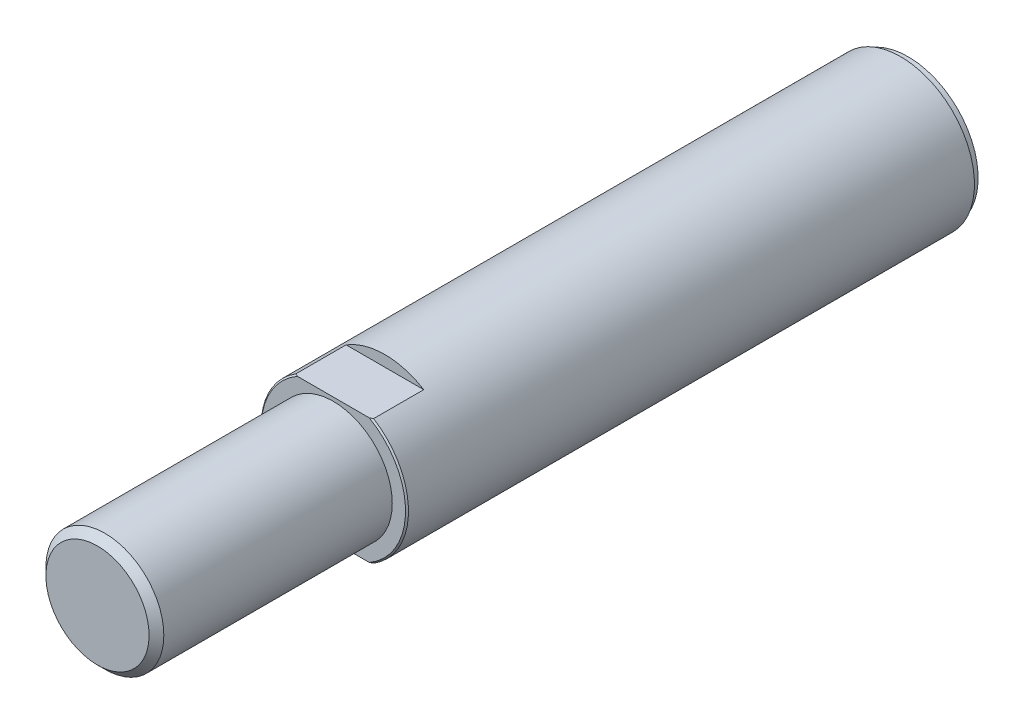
from build123d import *

# Parameters (mm, degrees)
ESBO_O1_R                      = 10
RESSALTO_EXTRUS_O1_DEPTH       = 110
ESBO_O2_OUTSIDE_W              = 44.716
ESBO_O2_OUTSIDE_H              = 44.716
ESBO_O2_OUTSIDE_R              = 8
CORTE_EXTRUS_O1_DEPTH          = 32
FURO_ROSCADO_DE_M10X1_51_D     = 8.5
FURO_ROSCADO_DE_M10X1_51_DEPTH = 27.5
FURO_ROSCADO_DE_M10X1_51_TIP   = 2.553657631
ESBO_O6_OUTSIDE_W              = 44.716
ESBO_O6_OUTSIDE_H              = 44.716
ESBO_O6_OUTSIDE_R              = 9.5
CORTE_EXTRUS_O2_DEPTH          = 1
CHANFRO1_SIZE                  = 1
CHANFRO2_SIZE                  = 0.2
ESBO_O7_OUTSIDE_W              = 44.716
ESBO_O7_OUTSIDE_H              = 44.716
ESBO_O7_OUTSIDE_W_2            = 31.474108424
ESBO_O7_OUTSIDE_H_2            = 17
CORTE_EXTRUS_O3_DEPTH          = 7


with BuildPart() as part:
    # Esbo_o1 → Ressalto-extrus_o1 (new body)
    with BuildSketch(Plane.XY):
        Circle(ESBO_O1_R)
    extrude(amount=RESSALTO_EXTRUS_O1_DEPTH)

    # Esbo_o2 outside → Corte-extrus_o1 (cut)
    with BuildSketch(Plane.XY.offset(110)):
        Rectangle(ESBO_O2_OUTSIDE_W, ESBO_O2_OUTSIDE_H)
        Circle(ESBO_O2_OUTSIDE_R, mode=Mode.SUBTRACT)
    extrude(amount=-CORTE_EXTRUS_O1_DEPTH, mode=Mode.SUBTRACT)

    # Furo roscado de M10x1.51
    with Locations(Plane(origin=(0, 0, 0), x_dir=(-1, 0, 0), z_dir=(0, 0, -1))):
        with Locations((0, 0)):
            Hole(FURO_ROSCADO_DE_M10X1_51_D / 2, depth=FURO_ROSCADO_DE_M10X1_51_DEPTH)
            with Locations((0, 0, -(FURO_ROSCADO_DE_M10X1_51_DEPTH + FURO_ROSCADO_DE_M10X1_51_TIP / 2))):  # 118° drill point
                Cone(0, FURO_ROSCADO_DE_M10X1_51_D / 2, FURO_ROSCADO_DE_M10X1_51_TIP, mode=Mode.SUBTRACT)

    # Esbo_o6 outside → Corte-extrus_o2 (cut)
    with BuildSketch(Plane(origin=(0, 0, 0), x_dir=(-1, 0, 0), z_dir=(0, 0, -1))):
        Rectangle(ESBO_O6_OUTSIDE_W, ESBO_O6_OUTSIDE_H)
        Circle(ESBO_O6_OUTSIDE_R, mode=Mode.SUBTRACT)
    extrude(amount=-CORTE_EXTRUS_O2_DEPTH, mode=Mode.SUBTRACT)

    # Chanfro1
    chanfro1_edges = [part.edges().sort_by_distance(p)[0] for p in [
        (-8, 0, 110),
    ]]
    chamfer(chanfro1_edges, length=CHANFRO1_SIZE)

    # Chanfro2
    chanfro2_edges = [part.edges().sort_by_distance(p)[0] for p in [
        (-10, 0, 78),
    ]]
    chamfer(chanfro2_edges, length=CHANFRO2_SIZE)

    # Esbo_o7 outside → Corte-extrus_o3 (cut)
    with BuildSketch(Plane.XY.offset(78)):
        Rectangle(ESBO_O7_OUTSIDE_W, ESBO_O7_OUTSIDE_H)
        Rectangle(ESBO_O7_OUTSIDE_W_2, ESBO_O7_OUTSIDE_H_2, mode=Mode.SUBTRACT)
    extrude(amount=-CORTE_EXTRUS_O3_DEPTH, mode=Mode.SUBTRACT)


solid = part.part
